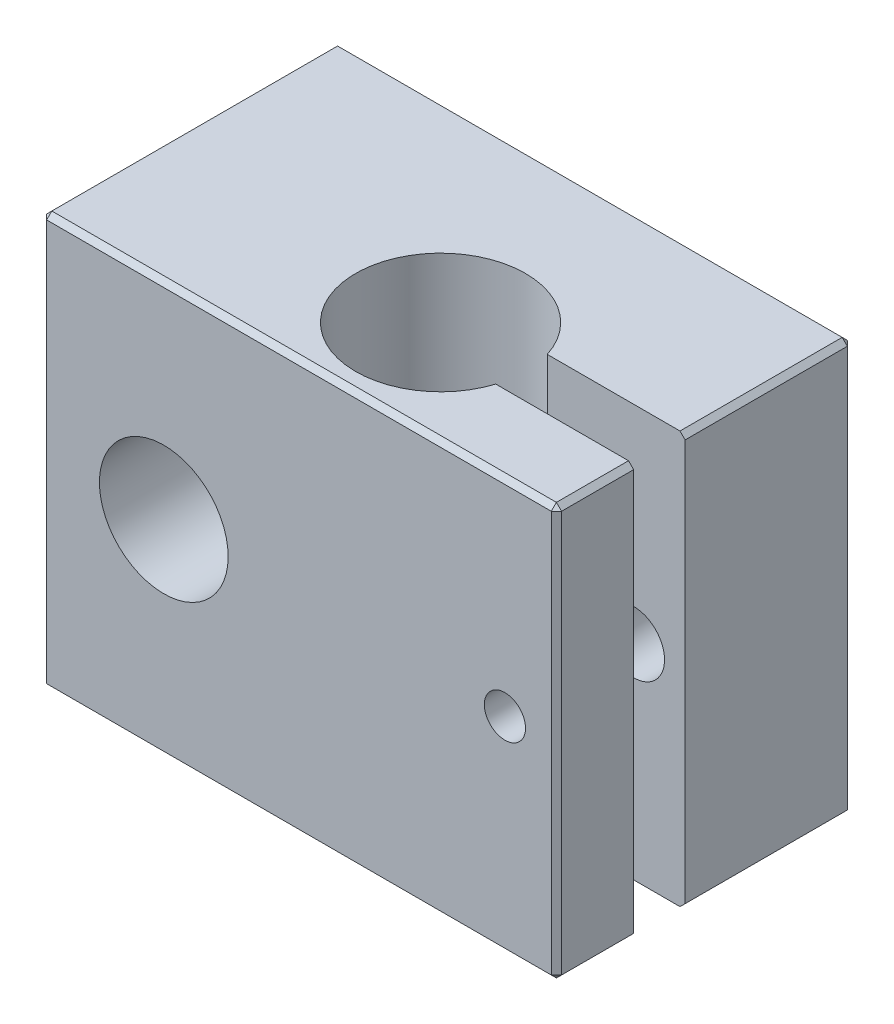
ISO-10303-21;
HEADER;
FILE_DESCRIPTION(('STEP AP214'),'2;1');
FILE_NAME('part.step','',(''),(''),'','','');
FILE_SCHEMA(('AUTOMOTIVE_DESIGN { 1 0 10303 214 1 1 1 1 }'));
ENDSEC;
DATA;
#1=APPLICATION_CONTEXT('core data for automotive mechanical design processes');
#2=APPLICATION_PROTOCOL_DEFINITION('international standard','automotive_design',2000,#1);
#3=PRODUCT_CONTEXT('',#1,'mechanical');
#4=PRODUCT('Part','Part','',(#3));
#5=PRODUCT_RELATED_PRODUCT_CATEGORY('part','',(#4));
#6=PRODUCT_DEFINITION_FORMATION('','',#4);
#7=PRODUCT_DEFINITION_CONTEXT('part definition',#1,'design');
#8=PRODUCT_DEFINITION('design','',#6,#7);
#9=PRODUCT_DEFINITION_SHAPE('','',#8);
#10=(LENGTH_UNIT() NAMED_UNIT(*) SI_UNIT(.MILLI.,.METRE.));
#11=(NAMED_UNIT(*) PLANE_ANGLE_UNIT() SI_UNIT($,.RADIAN.));
#12=(NAMED_UNIT(*) SI_UNIT($,.STERADIAN.) SOLID_ANGLE_UNIT());
#13=UNCERTAINTY_MEASURE_WITH_UNIT(LENGTH_MEASURE(1.E-05),#10,'distance_accuracy_value','');
#14=(GEOMETRIC_REPRESENTATION_CONTEXT(3) GLOBAL_UNCERTAINTY_ASSIGNED_CONTEXT((#13)) GLOBAL_UNIT_ASSIGNED_CONTEXT((#10,
#11,#12)) REPRESENTATION_CONTEXT('',''));
#15=CARTESIAN_POINT('',(0.,0.,0.));
#16=DIRECTION('',(0.,0.,1.));
#17=DIRECTION('',(1.,0.,0.));
#18=AXIS2_PLACEMENT_3D('',#15,#16,#17);
#19=CARTESIAN_POINT('',(0.,0.,0.));
#20=DIRECTION('',(0.,0.,1.));
#21=DIRECTION('',(1.,0.,0.));
#22=AXIS2_PLACEMENT_3D('',#19,#20,#21);
#23=PLANE('',#22);
#24=DIRECTION('',(0.,-1.,0.));
#25=VECTOR('',#24,1.);
#26=CARTESIAN_POINT('',(15.05,0.,0.));
#27=LINE('',#26,#25);
#28=CARTESIAN_POINT('',(15.05,7.8,0.));
#29=VERTEX_POINT('',#28);
#30=CARTESIAN_POINT('',(15.05,-7.8,0.));
#31=VERTEX_POINT('',#30);
#32=EDGE_CURVE('E241',#29,#31,#27,.T.);
#33=ORIENTED_EDGE('',*,*,#32,.T.);
#34=DIRECTION('',(-1.,0.,0.));
#35=VECTOR('',#34,1.);
#36=CARTESIAN_POINT('',(0.,-7.8,0.));
#37=LINE('',#36,#35);
#38=CARTESIAN_POINT('',(-4.55,-7.8,0.));
#39=VERTEX_POINT('',#38);
#40=EDGE_CURVE('E245',#31,#39,#37,.T.);
#41=ORIENTED_EDGE('',*,*,#40,.T.);
#42=DIRECTION('',(0.,1.,0.));
#43=VECTOR('',#42,1.);
#44=CARTESIAN_POINT('',(-4.55,0.,0.));
#45=LINE('',#44,#43);
#46=CARTESIAN_POINT('',(-4.55,7.8,0.));
#47=VERTEX_POINT('',#46);
#48=EDGE_CURVE('E243',#39,#47,#45,.T.);
#49=ORIENTED_EDGE('',*,*,#48,.T.);
#50=DIRECTION('',(1.,0.,0.));
#51=VECTOR('',#50,1.);
#52=CARTESIAN_POINT('',(0.,7.8,0.));
#53=LINE('',#52,#51);
#54=EDGE_CURVE('E239',#47,#29,#53,.T.);
#55=ORIENTED_EDGE('',*,*,#54,.T.);
#56=EDGE_LOOP('',(#33,#41,#49,#55));
#57=FACE_BOUND('',#56,.T.);
#58=CARTESIAN_POINT('',(0.,0.,0.));
#59=DIRECTION('',(0.,0.,1.));
#60=DIRECTION('',(1.,0.,0.));
#61=AXIS2_PLACEMENT_3D('',#58,#59,#60);
#62=CIRCLE('',#61,2.5);
#63=CARTESIAN_POINT('',(2.5,0.,0.));
#64=VERTEX_POINT('',#63);
#65=EDGE_CURVE('E181',#64,#64,#62,.T.);
#66=ORIENTED_EDGE('',*,*,#65,.T.);
#67=EDGE_LOOP('',(#66));
#68=FACE_BOUND('',#67,.T.);
#69=CARTESIAN_POINT('',(13.25,0.,0.));
#70=DIRECTION('',(0.,0.,-1.));
#71=DIRECTION('',(-1.,0.,0.));
#72=AXIS2_PLACEMENT_3D('',#69,#70,#71);
#73=CIRCLE('',#72,1.19999999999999);
#74=CARTESIAN_POINT('',(12.05,0.,0.));
#75=VERTEX_POINT('',#74);
#76=EDGE_CURVE('E357',#75,#75,#73,.T.);
#77=ORIENTED_EDGE('',*,*,#76,.F.);
#78=EDGE_LOOP('',(#77));
#79=FACE_BOUND('',#78,.T.);
#80=ADVANCED_FACE('F38',(#57,#68,#79),#23,.F.);
#81=CARTESIAN_POINT('',(15.25,8.,11.5));
#82=DIRECTION('',(-1.,0.,0.));
#83=DIRECTION('',(0.,-1.,0.));
#84=AXIS2_PLACEMENT_3D('',#81,#82,#83);
#85=PLANE('',#84);
#86=DIRECTION('',(0.,-1.,0.));
#87=VECTOR('',#86,1.);
#88=CARTESIAN_POINT('',(15.25,-8.,11.3));
#89=LINE('',#88,#87);
#90=CARTESIAN_POINT('',(15.25,7.8,11.3));
#91=VERTEX_POINT('',#90);
#92=CARTESIAN_POINT('',(15.25,-7.8,11.3));
#93=VERTEX_POINT('',#92);
#94=EDGE_CURVE('E277',#91,#93,#89,.T.);
#95=ORIENTED_EDGE('',*,*,#94,.T.);
#96=DIRECTION('',(0.,0.,-1.));
#97=VECTOR('',#96,1.);
#98=CARTESIAN_POINT('',(15.25,-7.8,11.5));
#99=LINE('',#98,#97);
#100=CARTESIAN_POINT('',(15.25,-7.8,8.5));
#101=VERTEX_POINT('',#100);
#102=EDGE_CURVE('E281',#93,#101,#99,.T.);
#103=ORIENTED_EDGE('',*,*,#102,.T.);
#104=DIRECTION('',(0.,1.,0.));
#105=VECTOR('',#104,1.);
#106=CARTESIAN_POINT('',(15.25,8.,8.5));
#107=LINE('',#106,#105);
#108=CARTESIAN_POINT('',(15.25,7.8,8.5));
#109=VERTEX_POINT('',#108);
#110=EDGE_CURVE('E198',#101,#109,#107,.T.);
#111=ORIENTED_EDGE('',*,*,#110,.T.);
#112=DIRECTION('',(0.,0.,1.));
#113=VECTOR('',#112,1.);
#114=CARTESIAN_POINT('',(15.25,7.8,11.5));
#115=LINE('',#114,#113);
#116=EDGE_CURVE('E279',#109,#91,#115,.T.);
#117=ORIENTED_EDGE('',*,*,#116,.T.);
#118=EDGE_LOOP('',(#95,#103,#111,#117));
#119=FACE_BOUND('',#118,.T.);
#120=ADVANCED_FACE('F487',(#119),#85,.F.);
#121=CARTESIAN_POINT('',(-4.75,8.,11.5));
#122=DIRECTION('',(1.,0.,0.));
#123=DIRECTION('',(0.,1.,0.));
#124=AXIS2_PLACEMENT_3D('',#121,#122,#123);
#125=PLANE('',#124);
#126=DIRECTION('',(0.,-1.,0.));
#127=VECTOR('',#126,1.);
#128=CARTESIAN_POINT('',(-4.75,8.,0.200000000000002));
#129=LINE('',#128,#127);
#130=CARTESIAN_POINT('',(-4.75,7.8,0.200000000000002));
#131=VERTEX_POINT('',#130);
#132=CARTESIAN_POINT('',(-4.75,-7.8,0.200000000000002));
#133=VERTEX_POINT('',#132);
#134=EDGE_CURVE('E252',#131,#133,#129,.T.);
#135=ORIENTED_EDGE('',*,*,#134,.T.);
#136=DIRECTION('',(0.,0.,1.));
#137=VECTOR('',#136,1.);
#138=CARTESIAN_POINT('',(-4.75,-7.8,11.5));
#139=LINE('',#138,#137);
#140=CARTESIAN_POINT('',(-4.75,-7.8,11.3));
#141=VERTEX_POINT('',#140);
#142=EDGE_CURVE('E254',#133,#141,#139,.T.);
#143=ORIENTED_EDGE('',*,*,#142,.T.);
#144=DIRECTION('',(0.,1.,0.));
#145=VECTOR('',#144,1.);
#146=CARTESIAN_POINT('',(-4.75,8.,11.3));
#147=LINE('',#146,#145);
#148=CARTESIAN_POINT('',(-4.75,7.8,11.3));
#149=VERTEX_POINT('',#148);
#150=EDGE_CURVE('E248',#141,#149,#147,.T.);
#151=ORIENTED_EDGE('',*,*,#150,.T.);
#152=DIRECTION('',(0.,0.,-1.));
#153=VECTOR('',#152,1.);
#154=CARTESIAN_POINT('',(-4.75,7.8,11.5));
#155=LINE('',#154,#153);
#156=EDGE_CURVE('E250',#149,#131,#155,.T.);
#157=ORIENTED_EDGE('',*,*,#156,.T.);
#158=EDGE_LOOP('',(#135,#143,#151,#157));
#159=FACE_BOUND('',#158,.T.);
#160=ADVANCED_FACE('F492',(#159),#125,.F.);
#161=CARTESIAN_POINT('',(-4.75,-8.,11.5));
#162=DIRECTION('',(0.,1.,0.));
#163=DIRECTION('',(0.,0.,1.));
#164=AXIS2_PLACEMENT_3D('',#161,#162,#163);
#165=PLANE('',#164);
#166=CARTESIAN_POINT('',(-1.25,-8.,6.5));
#167=DIRECTION('',(0.,-1.,0.));
#168=DIRECTION('',(0.,0.,-1.));
#169=AXIS2_PLACEMENT_3D('',#166,#167,#168);
#170=CIRCLE('',#169,1.025);
#171=CARTESIAN_POINT('',(-1.25,-8.,5.475));
#172=VERTEX_POINT('',#171);
#173=EDGE_CURVE('E200',#172,#172,#170,.T.);
#174=ORIENTED_EDGE('',*,*,#173,.F.);
#175=EDGE_LOOP('',(#174));
#176=FACE_BOUND('',#175,.T.);
#177=CARTESIAN_POINT('',(-2.25,-8.,9.));
#178=DIRECTION('',(0.,-1.,0.));
#179=DIRECTION('',(0.,0.,-1.));
#180=AXIS2_PLACEMENT_3D('',#177,#178,#179);
#181=CIRCLE('',#180,1.00000000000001);
#182=CARTESIAN_POINT('',(-2.25,-8.,7.99999999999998));
#183=VERTEX_POINT('',#182);
#184=EDGE_CURVE('E212',#183,#183,#181,.T.);
#185=ORIENTED_EDGE('',*,*,#184,.F.);
#186=EDGE_LOOP('',(#185));
#187=FACE_BOUND('',#186,.T.);
#188=DIRECTION('',(1.,0.,0.));
#189=VECTOR('',#188,1.);
#190=CARTESIAN_POINT('',(-4.75,-8.,0.200000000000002));
#191=LINE('',#190,#189);
#192=CARTESIAN_POINT('',(-4.55,-8.,0.200000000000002));
#193=VERTEX_POINT('',#192);
#194=CARTESIAN_POINT('',(15.05,-8.,0.200000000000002));
#195=VERTEX_POINT('',#194);
#196=EDGE_CURVE('E236',#193,#195,#191,.T.);
#197=ORIENTED_EDGE('',*,*,#196,.T.);
#198=DIRECTION('',(0.,0.,1.));
#199=VECTOR('',#198,1.);
#200=CARTESIAN_POINT('',(15.05,-8.,11.5));
#201=LINE('',#200,#199);
#202=CARTESIAN_POINT('',(15.05,-8.,6.5));
#203=VERTEX_POINT('',#202);
#204=EDGE_CURVE('E190',#195,#203,#201,.T.);
#205=ORIENTED_EDGE('',*,*,#204,.T.);
#206=DIRECTION('',(1.,0.,0.));
#207=VECTOR('',#206,1.);
#208=CARTESIAN_POINT('',(6.75,-8.,6.5));
#209=LINE('',#208,#207);
#210=CARTESIAN_POINT('',(9.89483703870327,-8.,6.5));
#211=VERTEX_POINT('',#210);
#212=EDGE_CURVE('E172',#211,#203,#209,.T.);
#213=ORIENTED_EDGE('',*,*,#212,.F.);
#214=CARTESIAN_POINT('',(6.75,-8.,7.5));
#215=DIRECTION('',(0.,-1.,0.));
#216=DIRECTION('',(0.,0.,-1.));
#217=AXIS2_PLACEMENT_3D('',#214,#215,#216);
#218=CIRCLE('',#217,3.29999999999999);
#219=CARTESIAN_POINT('',(9.89483703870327,-8.,8.5));
#220=VERTEX_POINT('',#219);
#221=EDGE_CURVE('E188',#220,#211,#218,.T.);
#222=ORIENTED_EDGE('',*,*,#221,.F.);
#223=DIRECTION('',(-1.,0.,0.));
#224=VECTOR('',#223,1.);
#225=CARTESIAN_POINT('',(6.75,-8.,8.5));
#226=LINE('',#225,#224);
#227=CARTESIAN_POINT('',(15.05,-8.,8.5));
#228=VERTEX_POINT('',#227);
#229=EDGE_CURVE('E191',#228,#220,#226,.T.);
#230=ORIENTED_EDGE('',*,*,#229,.F.);
#231=DIRECTION('',(0.,0.,1.));
#232=VECTOR('',#231,1.);
#233=CARTESIAN_POINT('',(15.05,-8.,11.5));
#234=LINE('',#233,#232);
#235=CARTESIAN_POINT('',(15.05,-8.,11.3));
#236=VERTEX_POINT('',#235);
#237=EDGE_CURVE('E232',#228,#236,#234,.T.);
#238=ORIENTED_EDGE('',*,*,#237,.T.);
#239=DIRECTION('',(-1.,0.,0.));
#240=VECTOR('',#239,1.);
#241=CARTESIAN_POINT('',(-4.75,-8.,11.3));
#242=LINE('',#241,#240);
#243=CARTESIAN_POINT('',(-4.55,-8.,11.3));
#244=VERTEX_POINT('',#243);
#245=EDGE_CURVE('E230',#236,#244,#242,.T.);
#246=ORIENTED_EDGE('',*,*,#245,.T.);
#247=DIRECTION('',(0.,0.,-1.));
#248=VECTOR('',#247,1.);
#249=CARTESIAN_POINT('',(-4.55,-8.,11.5));
#250=LINE('',#249,#248);
#251=EDGE_CURVE('E234',#244,#193,#250,.T.);
#252=ORIENTED_EDGE('',*,*,#251,.T.);
#253=EDGE_LOOP('',(#197,#205,#213,#222,#230,#238,#246,#252));
#254=FACE_BOUND('',#253,.T.);
#255=ADVANCED_FACE('F186',(#176,#187,#254),#165,.F.);
#256=DIRECTION('',(0.,-1.,0.));
#257=VECTOR('',#256,1.);
#258=CARTESIAN_POINT('',(15.25,8.,6.5));
#259=LINE('',#258,#257);
#260=CARTESIAN_POINT('',(15.25,7.8,6.5));
#261=VERTEX_POINT('',#260);
#262=CARTESIAN_POINT('',(15.25,-7.8,6.5));
#263=VERTEX_POINT('',#262);
#264=EDGE_CURVE('E203',#261,#263,#259,.T.);
#265=ORIENTED_EDGE('',*,*,#264,.T.);
#266=DIRECTION('',(0.,0.,-1.));
#267=VECTOR('',#266,1.);
#268=CARTESIAN_POINT('',(15.25,-7.8,11.5));
#269=LINE('',#268,#267);
#270=CARTESIAN_POINT('',(15.25,-7.8,0.200000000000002));
#271=VERTEX_POINT('',#270);
#272=EDGE_CURVE('E261',#263,#271,#269,.T.);
#273=ORIENTED_EDGE('',*,*,#272,.T.);
#274=DIRECTION('',(0.,1.,0.));
#275=VECTOR('',#274,1.);
#276=CARTESIAN_POINT('',(15.25,8.,0.200000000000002));
#277=LINE('',#276,#275);
#278=CARTESIAN_POINT('',(15.25,7.8,0.200000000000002));
#279=VERTEX_POINT('',#278);
#280=EDGE_CURVE('E259',#271,#279,#277,.T.);
#281=ORIENTED_EDGE('',*,*,#280,.T.);
#282=DIRECTION('',(0.,0.,1.));
#283=VECTOR('',#282,1.);
#284=CARTESIAN_POINT('',(15.25,7.8,11.5));
#285=LINE('',#284,#283);
#286=EDGE_CURVE('E257',#279,#261,#285,.T.);
#287=ORIENTED_EDGE('',*,*,#286,.T.);
#288=EDGE_LOOP('',(#265,#273,#281,#287));
#289=FACE_BOUND('',#288,.T.);
#290=ADVANCED_FACE('F381',(#289),#85,.F.);
#291=CARTESIAN_POINT('',(-4.75,8.,11.5));
#292=DIRECTION('',(0.,-1.,0.));
#293=DIRECTION('',(0.,0.,-1.));
#294=AXIS2_PLACEMENT_3D('',#291,#292,#293);
#295=PLANE('',#294);
#296=DIRECTION('',(1.,0.,0.));
#297=VECTOR('',#296,1.);
#298=CARTESIAN_POINT('',(6.75,8.,6.5));
#299=LINE('',#298,#297);
#300=CARTESIAN_POINT('',(9.89483703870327,8.,6.5));
#301=VERTEX_POINT('',#300);
#302=CARTESIAN_POINT('',(15.05,8.,6.5));
#303=VERTEX_POINT('',#302);
#304=EDGE_CURVE('E175',#301,#303,#299,.T.);
#305=ORIENTED_EDGE('',*,*,#304,.T.);
#306=DIRECTION('',(0.,0.,-1.));
#307=VECTOR('',#306,1.);
#308=CARTESIAN_POINT('',(15.05,8.,11.5));
#309=LINE('',#308,#307);
#310=CARTESIAN_POINT('',(15.05,8.,0.200000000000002));
#311=VERTEX_POINT('',#310);
#312=EDGE_CURVE('E275',#303,#311,#309,.T.);
#313=ORIENTED_EDGE('',*,*,#312,.T.);
#314=DIRECTION('',(-1.,0.,0.));
#315=VECTOR('',#314,1.);
#316=CARTESIAN_POINT('',(-4.75,8.,0.200000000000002));
#317=LINE('',#316,#315);
#318=CARTESIAN_POINT('',(-4.55,8.,0.200000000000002));
#319=VERTEX_POINT('',#318);
#320=EDGE_CURVE('E273',#311,#319,#317,.T.);
#321=ORIENTED_EDGE('',*,*,#320,.T.);
#322=DIRECTION('',(0.,0.,1.));
#323=VECTOR('',#322,1.);
#324=CARTESIAN_POINT('',(-4.55,8.,11.5));
#325=LINE('',#324,#323);
#326=CARTESIAN_POINT('',(-4.55,8.,11.3));
#327=VERTEX_POINT('',#326);
#328=EDGE_CURVE('E271',#319,#327,#325,.T.);
#329=ORIENTED_EDGE('',*,*,#328,.T.);
#330=DIRECTION('',(1.,0.,0.));
#331=VECTOR('',#330,1.);
#332=CARTESIAN_POINT('',(15.25,8.,11.3));
#333=LINE('',#332,#331);
#334=CARTESIAN_POINT('',(15.05,8.,11.3));
#335=VERTEX_POINT('',#334);
#336=EDGE_CURVE('E267',#327,#335,#333,.T.);
#337=ORIENTED_EDGE('',*,*,#336,.T.);
#338=DIRECTION('',(0.,0.,-1.));
#339=VECTOR('',#338,1.);
#340=CARTESIAN_POINT('',(15.05,8.,11.5));
#341=LINE('',#340,#339);
#342=CARTESIAN_POINT('',(15.05,8.,8.5));
#343=VERTEX_POINT('',#342);
#344=EDGE_CURVE('E269',#335,#343,#341,.T.);
#345=ORIENTED_EDGE('',*,*,#344,.T.);
#346=DIRECTION('',(-1.,0.,0.));
#347=VECTOR('',#346,1.);
#348=CARTESIAN_POINT('',(6.75,8.,8.5));
#349=LINE('',#348,#347);
#350=CARTESIAN_POINT('',(9.89483703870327,8.,8.5));
#351=VERTEX_POINT('',#350);
#352=EDGE_CURVE('E375',#343,#351,#349,.T.);
#353=ORIENTED_EDGE('',*,*,#352,.T.);
#354=CARTESIAN_POINT('',(6.75,8.,7.5));
#355=DIRECTION('',(0.,-1.,0.));
#356=DIRECTION('',(0.,0.,-1.));
#357=AXIS2_PLACEMENT_3D('',#354,#355,#356);
#358=CIRCLE('',#357,3.3);
#359=EDGE_CURVE('E197',#351,#301,#358,.T.);
#360=ORIENTED_EDGE('',*,*,#359,.T.);
#361=EDGE_LOOP('',(#305,#313,#321,#329,#337,#345,#353,#360));
#362=FACE_BOUND('',#361,.T.);
#363=ADVANCED_FACE('F417',(#362),#295,.F.);
#364=CARTESIAN_POINT('',(0.,0.,11.5));
#365=DIRECTION('',(0.,0.,1.));
#366=DIRECTION('',(1.,0.,0.));
#367=AXIS2_PLACEMENT_3D('',#364,#365,#366);
#368=PLANE('',#367);
#369=DIRECTION('',(0.,-1.,0.));
#370=VECTOR('',#369,1.);
#371=CARTESIAN_POINT('',(-4.55,-8.,11.5));
#372=LINE('',#371,#370);
#373=CARTESIAN_POINT('',(-4.55,7.8,11.5));
#374=VERTEX_POINT('',#373);
#375=CARTESIAN_POINT('',(-4.55,-7.8,11.5));
#376=VERTEX_POINT('',#375);
#377=EDGE_CURVE('E287',#374,#376,#372,.T.);
#378=ORIENTED_EDGE('',*,*,#377,.T.);
#379=DIRECTION('',(1.,0.,0.));
#380=VECTOR('',#379,1.);
#381=CARTESIAN_POINT('',(15.25,-7.8,11.5));
#382=LINE('',#381,#380);
#383=CARTESIAN_POINT('',(15.05,-7.8,11.5));
#384=VERTEX_POINT('',#383);
#385=EDGE_CURVE('E11',#376,#384,#382,.T.);
#386=ORIENTED_EDGE('',*,*,#385,.T.);
#387=DIRECTION('',(0.,1.,0.));
#388=VECTOR('',#387,1.);
#389=CARTESIAN_POINT('',(15.05,8.,11.5));
#390=LINE('',#389,#388);
#391=CARTESIAN_POINT('',(15.05,7.8,11.5));
#392=VERTEX_POINT('',#391);
#393=EDGE_CURVE('E47',#384,#392,#390,.T.);
#394=ORIENTED_EDGE('',*,*,#393,.T.);
#395=DIRECTION('',(-1.,0.,0.));
#396=VECTOR('',#395,1.);
#397=CARTESIAN_POINT('',(-4.75,7.8,11.5));
#398=LINE('',#397,#396);
#399=EDGE_CURVE('E289',#392,#374,#398,.T.);
#400=ORIENTED_EDGE('',*,*,#399,.T.);
#401=EDGE_LOOP('',(#378,#386,#394,#400));
#402=FACE_BOUND('',#401,.T.);
#403=CARTESIAN_POINT('',(13.25,0.,11.5));
#404=DIRECTION('',(0.,0.,1.));
#405=DIRECTION('',(1.,0.,0.));
#406=AXIS2_PLACEMENT_3D('',#403,#404,#405);
#407=CIRCLE('',#406,0.799999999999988);
#408=CARTESIAN_POINT('',(14.05,0.,11.5));
#409=VERTEX_POINT('',#408);
#410=EDGE_CURVE('E367',#409,#409,#407,.T.);
#411=ORIENTED_EDGE('',*,*,#410,.F.);
#412=EDGE_LOOP('',(#411));
#413=FACE_BOUND('',#412,.T.);
#414=CARTESIAN_POINT('',(0.,0.,11.5));
#415=DIRECTION('',(0.,0.,1.));
#416=DIRECTION('',(1.,0.,0.));
#417=AXIS2_PLACEMENT_3D('',#414,#415,#416);
#418=CIRCLE('',#417,2.49999999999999);
#419=CARTESIAN_POINT('',(2.49999999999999,0.,11.5));
#420=VERTEX_POINT('',#419);
#421=EDGE_CURVE('E224',#420,#420,#418,.T.);
#422=ORIENTED_EDGE('',*,*,#421,.F.);
#423=EDGE_LOOP('',(#422));
#424=FACE_BOUND('',#423,.T.);
#425=ADVANCED_FACE('F466',(#402,#413,#424),#368,.T.);
#426=CARTESIAN_POINT('',(0.,0.,11.5));
#427=DIRECTION('',(0.,0.,1.));
#428=DIRECTION('',(1.,0.,0.));
#429=AXIS2_PLACEMENT_3D('',#426,#427,#428);
#430=CYLINDRICAL_SURFACE('',#429,2.49999999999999);
#431=ORIENTED_EDGE('',*,*,#65,.F.);
#432=EDGE_LOOP('',(#431));
#433=FACE_BOUND('',#432,.T.);
#434=ORIENTED_EDGE('',*,*,#421,.T.);
#435=EDGE_LOOP('',(#434));
#436=FACE_BOUND('',#435,.T.);
#437=ADVANCED_FACE('F469',(#433,#436),#430,.F.);
#438=CARTESIAN_POINT('',(-2.25,-3.5,9.));
#439=DIRECTION('',(0.,1.,0.));
#440=DIRECTION('',(0.,0.,1.));
#441=AXIS2_PLACEMENT_3D('',#438,#439,#440);
#442=PLANE('',#441);
#443=CARTESIAN_POINT('',(-2.25,-3.5,9.));
#444=DIRECTION('',(0.,-1.,0.));
#445=DIRECTION('',(0.,0.,-1.));
#446=AXIS2_PLACEMENT_3D('',#443,#444,#445);
#447=CIRCLE('',#446,0.500000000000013);
#448=CARTESIAN_POINT('',(-2.25,-3.5,8.49999999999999));
#449=VERTEX_POINT('',#448);
#450=EDGE_CURVE('E221',#449,#449,#447,.T.);
#451=ORIENTED_EDGE('',*,*,#450,.T.);
#452=EDGE_LOOP('',(#451));
#453=FACE_BOUND('',#452,.T.);
#454=ADVANCED_FACE('F476',(#453),#442,.F.);
#455=CARTESIAN_POINT('',(-2.25,-8.,9.));
#456=DIRECTION('',(0.,-1.,0.));
#457=DIRECTION('',(0.,0.,-1.));
#458=AXIS2_PLACEMENT_3D('',#455,#456,#457);
#459=CYLINDRICAL_SURFACE('',#458,0.500000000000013);
#460=ORIENTED_EDGE('',*,*,#450,.F.);
#461=EDGE_LOOP('',(#460));
#462=FACE_BOUND('',#461,.T.);
#463=CARTESIAN_POINT('',(-2.25,-6.,9.));
#464=DIRECTION('',(0.,-1.,0.));
#465=DIRECTION('',(0.,0.,-1.));
#466=AXIS2_PLACEMENT_3D('',#463,#464,#465);
#467=CIRCLE('',#466,0.500000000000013);
#468=CARTESIAN_POINT('',(-2.25,-6.,8.49999999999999));
#469=VERTEX_POINT('',#468);
#470=EDGE_CURVE('E218',#469,#469,#467,.T.);
#471=ORIENTED_EDGE('',*,*,#470,.T.);
#472=EDGE_LOOP('',(#471));
#473=FACE_BOUND('',#472,.T.);
#474=ADVANCED_FACE('F482',(#462,#473),#459,.F.);
#475=CARTESIAN_POINT('',(-1.74999999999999,-6.,9.));
#476=DIRECTION('',(0.,1.,0.));
#477=DIRECTION('',(0.,0.,1.));
#478=AXIS2_PLACEMENT_3D('',#475,#476,#477);
#479=PLANE('',#478);
#480=ORIENTED_EDGE('',*,*,#470,.F.);
#481=EDGE_LOOP('',(#480));
#482=FACE_BOUND('',#481,.T.);
#483=CARTESIAN_POINT('',(-2.25,-6.,9.));
#484=DIRECTION('',(0.,-1.,0.));
#485=DIRECTION('',(0.,0.,-1.));
#486=AXIS2_PLACEMENT_3D('',#483,#484,#485);
#487=CIRCLE('',#486,1.00000000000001);
#488=CARTESIAN_POINT('',(-2.25,-6.,7.99999999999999));
#489=VERTEX_POINT('',#488);
#490=EDGE_CURVE('E215',#489,#489,#487,.T.);
#491=ORIENTED_EDGE('',*,*,#490,.T.);
#492=EDGE_LOOP('',(#491));
#493=FACE_BOUND('',#492,.T.);
#494=ADVANCED_FACE('F589',(#482,#493),#479,.F.);
#495=CARTESIAN_POINT('',(-2.25,-8.,9.));
#496=DIRECTION('',(0.,-1.,0.));
#497=DIRECTION('',(0.,0.,-1.));
#498=AXIS2_PLACEMENT_3D('',#495,#496,#497);
#499=CYLINDRICAL_SURFACE('',#498,1.00000000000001);
#500=ORIENTED_EDGE('',*,*,#490,.F.);
#501=EDGE_LOOP('',(#500));
#502=FACE_BOUND('',#501,.T.);
#503=ORIENTED_EDGE('',*,*,#184,.T.);
#504=EDGE_LOOP('',(#503));
#505=FACE_BOUND('',#504,.T.);
#506=ADVANCED_FACE('F585',(#502,#505),#499,.F.);
#507=CARTESIAN_POINT('',(-1.25,-3.5,6.5));
#508=DIRECTION('',(0.,-1.,0.));
#509=DIRECTION('',(0.,0.,-1.));
#510=AXIS2_PLACEMENT_3D('',#507,#508,#509);
#511=CONICAL_SURFACE('',#510,1.025,1.02974425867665);
#512=CARTESIAN_POINT('',(-1.25,-2.88411786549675,6.5));
#513=VERTEX_POINT('',#512);
#514=VERTEX_LOOP('',#513);
#515=FACE_BOUND('',#514,.T.);
#516=CARTESIAN_POINT('',(-1.25,-3.5,6.5));
#517=DIRECTION('',(0.,-1.,0.));
#518=DIRECTION('',(0.,0.,-1.));
#519=AXIS2_PLACEMENT_3D('',#516,#517,#518);
#520=CIRCLE('',#519,1.025);
#521=CARTESIAN_POINT('',(-1.25,-3.5,5.475));
#522=VERTEX_POINT('',#521);
#523=EDGE_CURVE('E209',#522,#522,#520,.T.);
#524=ORIENTED_EDGE('',*,*,#523,.T.);
#525=EDGE_LOOP('',(#524));
#526=FACE_BOUND('',#525,.T.);
#527=ADVANCED_FACE('F581',(#515,#526),#511,.F.);
#528=CARTESIAN_POINT('',(-1.25,-8.,6.5));
#529=DIRECTION('',(0.,-1.,0.));
#530=DIRECTION('',(0.,0.,-1.));
#531=AXIS2_PLACEMENT_3D('',#528,#529,#530);
#532=CYLINDRICAL_SURFACE('',#531,1.025);
#533=ORIENTED_EDGE('',*,*,#523,.F.);
#534=EDGE_LOOP('',(#533));
#535=FACE_BOUND('',#534,.T.);
#536=ORIENTED_EDGE('',*,*,#173,.T.);
#537=EDGE_LOOP('',(#536));
#538=FACE_BOUND('',#537,.T.);
#539=ADVANCED_FACE('F578',(#535,#538),#532,.F.);
#540=CARTESIAN_POINT('',(6.75,-8.,7.5));
#541=DIRECTION('',(0.,-1.,0.));
#542=DIRECTION('',(0.,0.,-1.));
#543=AXIS2_PLACEMENT_3D('',#540,#541,#542);
#544=CYLINDRICAL_SURFACE('',#543,3.29999999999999);
#545=ORIENTED_EDGE('',*,*,#359,.F.);
#546=DIRECTION('',(0.,-1.,0.));
#547=VECTOR('',#546,1.);
#548=CARTESIAN_POINT('',(9.89483703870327,-8.,8.5));
#549=LINE('',#548,#547);
#550=EDGE_CURVE('E180',#351,#220,#549,.T.);
#551=ORIENTED_EDGE('',*,*,#550,.T.);
#552=ORIENTED_EDGE('',*,*,#221,.T.);
#553=DIRECTION('',(0.,-1.,0.));
#554=VECTOR('',#553,1.);
#555=CARTESIAN_POINT('',(9.89483703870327,-8.,6.5));
#556=LINE('',#555,#554);
#557=EDGE_CURVE('E169',#211,#301,#556,.F.);
#558=ORIENTED_EDGE('',*,*,#557,.T.);
#559=EDGE_LOOP('',(#545,#551,#552,#558));
#560=FACE_BOUND('',#559,.T.);
#561=ADVANCED_FACE('F195',(#560),#544,.F.);
#562=CARTESIAN_POINT('',(6.75,8.,6.5));
#563=DIRECTION('',(0.,0.,-1.));
#564=DIRECTION('',(-1.,0.,0.));
#565=AXIS2_PLACEMENT_3D('',#562,#563,#564);
#566=PLANE('',#565);
#567=CARTESIAN_POINT('',(13.25,0.,6.5));
#568=DIRECTION('',(0.,0.,-1.));
#569=DIRECTION('',(-1.,0.,0.));
#570=AXIS2_PLACEMENT_3D('',#567,#568,#569);
#571=CIRCLE('',#570,1.19999999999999);
#572=CARTESIAN_POINT('',(12.05,0.,6.5));
#573=VERTEX_POINT('',#572);
#574=EDGE_CURVE('E362',#573,#573,#571,.T.);
#575=ORIENTED_EDGE('',*,*,#574,.T.);
#576=EDGE_LOOP('',(#575));
#577=FACE_BOUND('',#576,.T.);
#578=ORIENTED_EDGE('',*,*,#212,.T.);
#579=DIRECTION('',(-0.707106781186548,-0.707106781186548,0.));
#580=VECTOR('',#579,1.);
#581=CARTESIAN_POINT('',(15.25,-7.8,6.5));
#582=LINE('',#581,#580);
#583=EDGE_CURVE('E265',#203,#263,#582,.F.);
#584=ORIENTED_EDGE('',*,*,#583,.T.);
#585=ORIENTED_EDGE('',*,*,#264,.F.);
#586=DIRECTION('',(0.707106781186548,-0.707106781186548,0.));
#587=VECTOR('',#586,1.);
#588=CARTESIAN_POINT('',(15.05,8.,6.5));
#589=LINE('',#588,#587);
#590=EDGE_CURVE('E263',#261,#303,#589,.F.);
#591=ORIENTED_EDGE('',*,*,#590,.T.);
#592=ORIENTED_EDGE('',*,*,#304,.F.);
#593=ORIENTED_EDGE('',*,*,#557,.F.);
#594=EDGE_LOOP('',(#578,#584,#585,#591,#592,#593));
#595=FACE_BOUND('',#594,.T.);
#596=ADVANCED_FACE('F171',(#577,#595),#566,.F.);
#597=CARTESIAN_POINT('',(6.75,8.,8.5));
#598=DIRECTION('',(0.,0.,1.));
#599=DIRECTION('',(1.,0.,0.));
#600=AXIS2_PLACEMENT_3D('',#597,#598,#599);
#601=PLANE('',#600);
#602=CARTESIAN_POINT('',(13.25,0.,8.5));
#603=DIRECTION('',(0.,0.,1.));
#604=DIRECTION('',(1.,0.,0.));
#605=AXIS2_PLACEMENT_3D('',#602,#603,#604);
#606=CIRCLE('',#605,0.799999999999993);
#607=CARTESIAN_POINT('',(14.05,0.,8.5));
#608=VERTEX_POINT('',#607);
#609=EDGE_CURVE('E192',#608,#608,#606,.T.);
#610=ORIENTED_EDGE('',*,*,#609,.T.);
#611=EDGE_LOOP('',(#610));
#612=FACE_BOUND('',#611,.T.);
#613=ORIENTED_EDGE('',*,*,#110,.F.);
#614=DIRECTION('',(0.707106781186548,0.707106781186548,0.));
#615=VECTOR('',#614,1.);
#616=CARTESIAN_POINT('',(15.25,-7.8,8.5));
#617=LINE('',#616,#615);
#618=EDGE_CURVE('E285',#101,#228,#617,.F.);
#619=ORIENTED_EDGE('',*,*,#618,.T.);
#620=ORIENTED_EDGE('',*,*,#229,.T.);
#621=ORIENTED_EDGE('',*,*,#550,.F.);
#622=ORIENTED_EDGE('',*,*,#352,.F.);
#623=DIRECTION('',(-0.707106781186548,0.707106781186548,0.));
#624=VECTOR('',#623,1.);
#625=CARTESIAN_POINT('',(15.05,8.,8.5));
#626=LINE('',#625,#624);
#627=EDGE_CURVE('E283',#343,#109,#626,.F.);
#628=ORIENTED_EDGE('',*,*,#627,.T.);
#629=EDGE_LOOP('',(#613,#619,#620,#621,#622,#628));
#630=FACE_BOUND('',#629,.T.);
#631=ADVANCED_FACE('F423',(#612,#630),#601,.F.);
#632=CARTESIAN_POINT('',(13.25,0.,11.5));
#633=DIRECTION('',(0.,0.,1.));
#634=DIRECTION('',(1.,0.,0.));
#635=AXIS2_PLACEMENT_3D('',#632,#633,#634);
#636=CYLINDRICAL_SURFACE('',#635,0.799999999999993);
#637=ORIENTED_EDGE('',*,*,#609,.F.);
#638=EDGE_LOOP('',(#637));
#639=FACE_BOUND('',#638,.T.);
#640=ORIENTED_EDGE('',*,*,#410,.T.);
#641=EDGE_LOOP('',(#640));
#642=FACE_BOUND('',#641,.T.);
#643=ADVANCED_FACE('F560',(#639,#642),#636,.F.);
#644=CARTESIAN_POINT('',(13.25,0.,0.));
#645=DIRECTION('',(0.,0.,-1.));
#646=DIRECTION('',(-1.,0.,0.));
#647=AXIS2_PLACEMENT_3D('',#644,#645,#646);
#648=CYLINDRICAL_SURFACE('',#647,1.19999999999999);
#649=ORIENTED_EDGE('',*,*,#574,.F.);
#650=EDGE_LOOP('',(#649));
#651=FACE_BOUND('',#650,.T.);
#652=ORIENTED_EDGE('',*,*,#76,.T.);
#653=EDGE_LOOP('',(#652));
#654=FACE_BOUND('',#653,.T.);
#655=ADVANCED_FACE('F553',(#651,#654),#648,.F.);
#656=CARTESIAN_POINT('',(15.05,8.,11.5));
#657=DIRECTION('',(-0.707106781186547,-0.707106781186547,0.));
#658=DIRECTION('',(0.,0.,-1.));
#659=AXIS2_PLACEMENT_3D('',#656,#657,#658);
#660=PLANE('',#659);
#661=DIRECTION('',(0.707106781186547,-0.707106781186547,0.));
#662=VECTOR('',#661,1.);
#663=CARTESIAN_POINT('',(15.25,7.8,11.3));
#664=LINE('',#663,#662);
#665=EDGE_CURVE('E42',#91,#335,#664,.F.);
#666=ORIENTED_EDGE('',*,*,#665,.F.);
#667=ORIENTED_EDGE('',*,*,#116,.F.);
#668=ORIENTED_EDGE('',*,*,#627,.F.);
#669=ORIENTED_EDGE('',*,*,#344,.F.);
#670=EDGE_LOOP('',(#666,#667,#668,#669));
#671=FACE_BOUND('',#670,.T.);
#672=ADVANCED_FACE('F40',(#671),#660,.F.);
#673=CARTESIAN_POINT('',(15.25,7.8,11.3));
#674=DIRECTION('',(0.577350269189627,0.577350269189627,0.577350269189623));
#675=DIRECTION('',(-0.707106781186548,0.707106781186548,0.));
#676=AXIS2_PLACEMENT_3D('',#673,#674,#675);
#677=PLANE('',#676);
#678=DIRECTION('',(0.707106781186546,0.,-0.707106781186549));
#679=VECTOR('',#678,1.);
#680=CARTESIAN_POINT('',(15.25,7.8,11.3));
#681=LINE('',#680,#679);
#682=EDGE_CURVE('E349',#91,#392,#681,.F.);
#683=ORIENTED_EDGE('',*,*,#682,.F.);
#684=ORIENTED_EDGE('',*,*,#665,.T.);
#685=DIRECTION('',(0.,-0.707106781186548,0.707106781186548));
#686=VECTOR('',#685,1.);
#687=CARTESIAN_POINT('',(15.05,7.9,11.4));
#688=LINE('',#687,#686);
#689=EDGE_CURVE('E350',#392,#335,#688,.F.);
#690=ORIENTED_EDGE('',*,*,#689,.F.);
#691=EDGE_LOOP('',(#683,#684,#690));
#692=FACE_BOUND('',#691,.T.);
#693=ADVANCED_FACE('F548',(#692),#677,.T.);
#694=CARTESIAN_POINT('',(0.,7.8,11.5));
#695=DIRECTION('',(0.,0.707106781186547,0.707106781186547));
#696=DIRECTION('',(1.,0.,0.));
#697=AXIS2_PLACEMENT_3D('',#694,#695,#696);
#698=PLANE('',#697);
#699=ORIENTED_EDGE('',*,*,#689,.T.);
#700=ORIENTED_EDGE('',*,*,#336,.F.);
#701=DIRECTION('',(0.,0.707106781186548,-0.707106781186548));
#702=VECTOR('',#701,1.);
#703=CARTESIAN_POINT('',(-4.55,8.,11.3));
#704=LINE('',#703,#702);
#705=EDGE_CURVE('E346',#374,#327,#704,.T.);
#706=ORIENTED_EDGE('',*,*,#705,.F.);
#707=ORIENTED_EDGE('',*,*,#399,.F.);
#708=EDGE_LOOP('',(#699,#700,#706,#707));
#709=FACE_BOUND('',#708,.T.);
#710=ADVANCED_FACE('F457',(#709),#698,.T.);
#711=CARTESIAN_POINT('',(15.05,0.,11.5));
#712=DIRECTION('',(0.707106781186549,0.,0.707106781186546));
#713=DIRECTION('',(0.,-1.,0.));
#714=AXIS2_PLACEMENT_3D('',#711,#712,#713);
#715=PLANE('',#714);
#716=ORIENTED_EDGE('',*,*,#682,.T.);
#717=ORIENTED_EDGE('',*,*,#393,.F.);
#718=DIRECTION('',(-0.707106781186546,0.,0.707106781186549));
#719=VECTOR('',#718,1.);
#720=CARTESIAN_POINT('',(15.15,-7.8,11.4));
#721=LINE('',#720,#719);
#722=EDGE_CURVE('E344',#93,#384,#721,.T.);
#723=ORIENTED_EDGE('',*,*,#722,.F.);
#724=ORIENTED_EDGE('',*,*,#94,.F.);
#725=EDGE_LOOP('',(#716,#717,#723,#724));
#726=FACE_BOUND('',#725,.T.);
#727=ADVANCED_FACE('F543',(#726),#715,.T.);
#728=CARTESIAN_POINT('',(15.25,-7.8,11.5));
#729=DIRECTION('',(-0.707106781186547,0.707106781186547,0.));
#730=DIRECTION('',(0.,0.,-1.));
#731=AXIS2_PLACEMENT_3D('',#728,#729,#730);
#732=PLANE('',#731);
#733=ORIENTED_EDGE('',*,*,#618,.F.);
#734=ORIENTED_EDGE('',*,*,#102,.F.);
#735=DIRECTION('',(-0.707106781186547,-0.707106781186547,0.));
#736=VECTOR('',#735,1.);
#737=CARTESIAN_POINT('',(15.05,-8.,11.3));
#738=LINE('',#737,#736);
#739=EDGE_CURVE('E341',#236,#93,#738,.F.);
#740=ORIENTED_EDGE('',*,*,#739,.F.);
#741=ORIENTED_EDGE('',*,*,#237,.F.);
#742=EDGE_LOOP('',(#733,#734,#740,#741));
#743=FACE_BOUND('',#742,.T.);
#744=ADVANCED_FACE('F428',(#743),#732,.F.);
#745=CARTESIAN_POINT('',(-4.55,8.,11.3));
#746=DIRECTION('',(-0.577350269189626,0.577350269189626,0.577350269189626));
#747=DIRECTION('',(0.707106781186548,0.,0.707106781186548));
#748=AXIS2_PLACEMENT_3D('',#745,#746,#747);
#749=PLANE('',#748);
#750=DIRECTION('',(0.707106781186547,0.,0.707106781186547));
#751=VECTOR('',#750,1.);
#752=CARTESIAN_POINT('',(-4.65,7.8,11.4));
#753=LINE('',#752,#751);
#754=EDGE_CURVE('E335',#374,#149,#753,.F.);
#755=ORIENTED_EDGE('',*,*,#754,.F.);
#756=ORIENTED_EDGE('',*,*,#705,.T.);
#757=DIRECTION('',(0.707106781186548,0.707106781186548,0.));
#758=VECTOR('',#757,1.);
#759=CARTESIAN_POINT('',(-4.55,8.,11.3));
#760=LINE('',#759,#758);
#761=EDGE_CURVE('E338',#149,#327,#760,.T.);
#762=ORIENTED_EDGE('',*,*,#761,.F.);
#763=EDGE_LOOP('',(#755,#756,#762));
#764=FACE_BOUND('',#763,.T.);
#765=ADVANCED_FACE('F460',(#764),#749,.T.);
#766=CARTESIAN_POINT('',(15.05,-8.,11.3));
#767=DIRECTION('',(0.577350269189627,-0.577350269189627,0.577350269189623));
#768=DIRECTION('',(0.707106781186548,0.707106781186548,0.));
#769=AXIS2_PLACEMENT_3D('',#766,#767,#768);
#770=PLANE('',#769);
#771=ORIENTED_EDGE('',*,*,#739,.T.);
#772=ORIENTED_EDGE('',*,*,#722,.T.);
#773=DIRECTION('',(0.,-0.707106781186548,-0.707106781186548));
#774=VECTOR('',#773,1.);
#775=CARTESIAN_POINT('',(15.05,-8.,11.3));
#776=LINE('',#775,#774);
#777=EDGE_CURVE('E55',#236,#384,#776,.F.);
#778=ORIENTED_EDGE('',*,*,#777,.F.);
#779=EDGE_LOOP('',(#771,#772,#778));
#780=FACE_BOUND('',#779,.T.);
#781=ADVANCED_FACE('F432',(#780),#770,.T.);
#782=CARTESIAN_POINT('',(-4.75,7.8,11.5));
#783=DIRECTION('',(0.707106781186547,-0.707106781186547,0.));
#784=DIRECTION('',(0.,0.,-1.));
#785=AXIS2_PLACEMENT_3D('',#782,#783,#784);
#786=PLANE('',#785);
#787=ORIENTED_EDGE('',*,*,#761,.T.);
#788=ORIENTED_EDGE('',*,*,#328,.F.);
#789=DIRECTION('',(-0.707106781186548,-0.707106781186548,0.));
#790=VECTOR('',#789,1.);
#791=CARTESIAN_POINT('',(-4.65,7.9,0.200000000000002));
#792=LINE('',#791,#790);
#793=EDGE_CURVE('E328',#131,#319,#792,.F.);
#794=ORIENTED_EDGE('',*,*,#793,.F.);
#795=ORIENTED_EDGE('',*,*,#156,.F.);
#796=EDGE_LOOP('',(#787,#788,#794,#795));
#797=FACE_BOUND('',#796,.T.);
#798=ADVANCED_FACE('F454',(#797),#786,.F.);
#799=CARTESIAN_POINT('',(-4.55,0.,11.5));
#800=DIRECTION('',(-0.707106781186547,0.,0.707106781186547));
#801=DIRECTION('',(0.,1.,0.));
#802=AXIS2_PLACEMENT_3D('',#799,#800,#801);
#803=PLANE('',#802);
#804=ORIENTED_EDGE('',*,*,#754,.T.);
#805=ORIENTED_EDGE('',*,*,#150,.F.);
#806=DIRECTION('',(-0.707106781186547,0.,-0.707106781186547));
#807=VECTOR('',#806,1.);
#808=CARTESIAN_POINT('',(-4.75,-7.8,11.3));
#809=LINE('',#808,#807);
#810=EDGE_CURVE('E325',#376,#141,#809,.T.);
#811=ORIENTED_EDGE('',*,*,#810,.F.);
#812=ORIENTED_EDGE('',*,*,#377,.F.);
#813=EDGE_LOOP('',(#804,#805,#811,#812));
#814=FACE_BOUND('',#813,.T.);
#815=ADVANCED_FACE('F465',(#814),#803,.T.);
#816=CARTESIAN_POINT('',(0.,-7.8,11.5));
#817=DIRECTION('',(0.,-0.707106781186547,0.707106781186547));
#818=DIRECTION('',(-1.,0.,0.));
#819=AXIS2_PLACEMENT_3D('',#816,#817,#818);
#820=PLANE('',#819);
#821=ORIENTED_EDGE('',*,*,#777,.T.);
#822=ORIENTED_EDGE('',*,*,#385,.F.);
#823=DIRECTION('',(0.,0.707106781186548,0.707106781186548));
#824=VECTOR('',#823,1.);
#825=CARTESIAN_POINT('',(-4.55,-7.9,11.4));
#826=LINE('',#825,#824);
#827=EDGE_CURVE('E322',#244,#376,#826,.T.);
#828=ORIENTED_EDGE('',*,*,#827,.F.);
#829=ORIENTED_EDGE('',*,*,#245,.F.);
#830=EDGE_LOOP('',(#821,#822,#828,#829));
#831=FACE_BOUND('',#830,.T.);
#832=ADVANCED_FACE('F434',(#831),#820,.T.);
#833=CARTESIAN_POINT('',(15.05,8.,11.5));
#834=DIRECTION('',(-0.707106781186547,-0.707106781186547,0.));
#835=DIRECTION('',(0.,0.,-1.));
#836=AXIS2_PLACEMENT_3D('',#833,#834,#835);
#837=PLANE('',#836);
#838=ORIENTED_EDGE('',*,*,#590,.F.);
#839=ORIENTED_EDGE('',*,*,#286,.F.);
#840=DIRECTION('',(-0.707106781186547,0.707106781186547,0.));
#841=VECTOR('',#840,1.);
#842=CARTESIAN_POINT('',(15.25,7.8,0.200000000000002));
#843=LINE('',#842,#841);
#844=EDGE_CURVE('E319',#311,#279,#843,.F.);
#845=ORIENTED_EDGE('',*,*,#844,.F.);
#846=ORIENTED_EDGE('',*,*,#312,.F.);
#847=EDGE_LOOP('',(#838,#839,#845,#846));
#848=FACE_BOUND('',#847,.T.);
#849=ADVANCED_FACE('F415',(#848),#837,.F.);
#850=CARTESIAN_POINT('',(-4.75,8.,0.200000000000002));
#851=DIRECTION('',(0.,-0.707106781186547,0.707106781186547));
#852=DIRECTION('',(-1.,0.,0.));
#853=AXIS2_PLACEMENT_3D('',#850,#851,#852);
#854=PLANE('',#853);
#855=DIRECTION('',(0.,0.707106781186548,0.707106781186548));
#856=VECTOR('',#855,1.);
#857=CARTESIAN_POINT('',(-4.55,7.8,0.));
#858=LINE('',#857,#856);
#859=EDGE_CURVE('E331',#319,#47,#858,.F.);
#860=ORIENTED_EDGE('',*,*,#859,.F.);
#861=ORIENTED_EDGE('',*,*,#320,.F.);
#862=DIRECTION('',(0.,-0.707106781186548,-0.707106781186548));
#863=VECTOR('',#862,1.);
#864=CARTESIAN_POINT('',(15.05,7.9,0.1));
#865=LINE('',#864,#863);
#866=EDGE_CURVE('E316',#29,#311,#865,.F.);
#867=ORIENTED_EDGE('',*,*,#866,.F.);
#868=ORIENTED_EDGE('',*,*,#54,.F.);
#869=EDGE_LOOP('',(#860,#861,#867,#868));
#870=FACE_BOUND('',#869,.T.);
#871=ADVANCED_FACE('F409',(#870),#854,.F.);
#872=CARTESIAN_POINT('',(-4.55,7.8,0.));
#873=DIRECTION('',(-0.577350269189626,0.577350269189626,-0.577350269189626));
#874=DIRECTION('',(-0.707106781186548,0.,0.707106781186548));
#875=AXIS2_PLACEMENT_3D('',#872,#873,#874);
#876=PLANE('',#875);
#877=ORIENTED_EDGE('',*,*,#793,.T.);
#878=ORIENTED_EDGE('',*,*,#859,.T.);
#879=DIRECTION('',(0.707106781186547,0.,-0.707106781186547));
#880=VECTOR('',#879,1.);
#881=CARTESIAN_POINT('',(-4.55,7.8,0.));
#882=LINE('',#881,#880);
#883=EDGE_CURVE('E313',#131,#47,#882,.T.);
#884=ORIENTED_EDGE('',*,*,#883,.F.);
#885=EDGE_LOOP('',(#877,#878,#884));
#886=FACE_BOUND('',#885,.T.);
#887=ADVANCED_FACE('F449',(#886),#876,.T.);
#888=CARTESIAN_POINT('',(-4.75,-7.8,11.3));
#889=DIRECTION('',(-0.577350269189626,-0.577350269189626,0.577350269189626));
#890=DIRECTION('',(0.707106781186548,0.,0.707106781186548));
#891=AXIS2_PLACEMENT_3D('',#888,#889,#890);
#892=PLANE('',#891);
#893=ORIENTED_EDGE('',*,*,#827,.T.);
#894=ORIENTED_EDGE('',*,*,#810,.T.);
#895=DIRECTION('',(-0.707106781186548,0.707106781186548,0.));
#896=VECTOR('',#895,1.);
#897=CARTESIAN_POINT('',(-4.75,-7.8,11.3));
#898=LINE('',#897,#896);
#899=EDGE_CURVE('E311',#244,#141,#898,.T.);
#900=ORIENTED_EDGE('',*,*,#899,.F.);
#901=EDGE_LOOP('',(#893,#894,#900));
#902=FACE_BOUND('',#901,.T.);
#903=ADVANCED_FACE('F521',(#902),#892,.T.);
#904=CARTESIAN_POINT('',(15.25,7.8,0.200000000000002));
#905=DIRECTION('',(0.577350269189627,0.577350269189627,-0.577350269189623));
#906=DIRECTION('',(-0.707106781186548,0.707106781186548,0.));
#907=AXIS2_PLACEMENT_3D('',#904,#905,#906);
#908=PLANE('',#907);
#909=ORIENTED_EDGE('',*,*,#866,.T.);
#910=ORIENTED_EDGE('',*,*,#844,.T.);
#911=DIRECTION('',(0.707106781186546,0.,0.707106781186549));
#912=VECTOR('',#911,1.);
#913=CARTESIAN_POINT('',(15.25,7.8,0.200000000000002));
#914=LINE('',#913,#912);
#915=EDGE_CURVE('E308',#29,#279,#914,.T.);
#916=ORIENTED_EDGE('',*,*,#915,.F.);
#917=EDGE_LOOP('',(#909,#910,#916));
#918=FACE_BOUND('',#917,.T.);
#919=ADVANCED_FACE('F412',(#918),#908,.T.);
#920=CARTESIAN_POINT('',(-4.75,8.,0.200000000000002));
#921=DIRECTION('',(0.707106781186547,0.,0.707106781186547));
#922=DIRECTION('',(0.,-1.,0.));
#923=AXIS2_PLACEMENT_3D('',#920,#921,#922);
#924=PLANE('',#923);
#925=ORIENTED_EDGE('',*,*,#883,.T.);
#926=ORIENTED_EDGE('',*,*,#48,.F.);
#927=DIRECTION('',(-0.707106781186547,0.,0.707106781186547));
#928=VECTOR('',#927,1.);
#929=CARTESIAN_POINT('',(-4.55,-7.8,0.));
#930=LINE('',#929,#928);
#931=EDGE_CURVE('E305',#133,#39,#930,.F.);
#932=ORIENTED_EDGE('',*,*,#931,.F.);
#933=ORIENTED_EDGE('',*,*,#134,.F.);
#934=EDGE_LOOP('',(#925,#926,#932,#933));
#935=FACE_BOUND('',#934,.T.);
#936=ADVANCED_FACE('F446',(#935),#924,.F.);
#937=CARTESIAN_POINT('',(-4.55,-8.,11.5));
#938=DIRECTION('',(0.707106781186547,0.707106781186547,0.));
#939=DIRECTION('',(0.,0.,-1.));
#940=AXIS2_PLACEMENT_3D('',#937,#938,#939);
#941=PLANE('',#940);
#942=ORIENTED_EDGE('',*,*,#899,.T.);
#943=ORIENTED_EDGE('',*,*,#142,.F.);
#944=DIRECTION('',(0.707106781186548,-0.707106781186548,0.));
#945=VECTOR('',#944,1.);
#946=CARTESIAN_POINT('',(-4.65,-7.9,0.200000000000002));
#947=LINE('',#946,#945);
#948=EDGE_CURVE('E302',#193,#133,#947,.F.);
#949=ORIENTED_EDGE('',*,*,#948,.F.);
#950=ORIENTED_EDGE('',*,*,#251,.F.);
#951=EDGE_LOOP('',(#942,#943,#949,#950));
#952=FACE_BOUND('',#951,.T.);
#953=ADVANCED_FACE('F440',(#952),#941,.F.);
#954=CARTESIAN_POINT('',(15.25,-7.8,11.5));
#955=DIRECTION('',(-0.707106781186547,0.707106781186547,0.));
#956=DIRECTION('',(0.,0.,-1.));
#957=AXIS2_PLACEMENT_3D('',#954,#955,#956);
#958=PLANE('',#957);
#959=ORIENTED_EDGE('',*,*,#583,.F.);
#960=ORIENTED_EDGE('',*,*,#204,.F.);
#961=DIRECTION('',(0.707106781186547,0.707106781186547,0.));
#962=VECTOR('',#961,1.);
#963=CARTESIAN_POINT('',(15.05,-8.,0.200000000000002));
#964=LINE('',#963,#962);
#965=EDGE_CURVE('E299',#271,#195,#964,.F.);
#966=ORIENTED_EDGE('',*,*,#965,.F.);
#967=ORIENTED_EDGE('',*,*,#272,.F.);
#968=EDGE_LOOP('',(#959,#960,#966,#967));
#969=FACE_BOUND('',#968,.T.);
#970=ADVANCED_FACE('F387',(#969),#958,.F.);
#971=CARTESIAN_POINT('',(15.25,8.,0.200000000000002));
#972=DIRECTION('',(-0.707106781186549,0.,0.707106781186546));
#973=DIRECTION('',(0.,1.,0.));
#974=AXIS2_PLACEMENT_3D('',#971,#972,#973);
#975=PLANE('',#974);
#976=ORIENTED_EDGE('',*,*,#915,.T.);
#977=ORIENTED_EDGE('',*,*,#280,.F.);
#978=DIRECTION('',(-0.707106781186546,0.,-0.707106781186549));
#979=VECTOR('',#978,1.);
#980=CARTESIAN_POINT('',(15.15,-7.8,0.100000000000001));
#981=LINE('',#980,#979);
#982=EDGE_CURVE('E296',#31,#271,#981,.F.);
#983=ORIENTED_EDGE('',*,*,#982,.F.);
#984=ORIENTED_EDGE('',*,*,#32,.F.);
#985=EDGE_LOOP('',(#976,#977,#983,#984));
#986=FACE_BOUND('',#985,.T.);
#987=ADVANCED_FACE('F395',(#986),#975,.F.);
#988=CARTESIAN_POINT('',(-4.55,-7.8,0.));
#989=DIRECTION('',(-0.577350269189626,-0.577350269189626,-0.577350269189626));
#990=DIRECTION('',(-0.707106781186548,0.,0.707106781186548));
#991=AXIS2_PLACEMENT_3D('',#988,#989,#990);
#992=PLANE('',#991);
#993=ORIENTED_EDGE('',*,*,#948,.T.);
#994=ORIENTED_EDGE('',*,*,#931,.T.);
#995=DIRECTION('',(0.,0.707106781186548,-0.707106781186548));
#996=VECTOR('',#995,1.);
#997=CARTESIAN_POINT('',(-4.55,-7.8,0.));
#998=LINE('',#997,#996);
#999=EDGE_CURVE('E294',#193,#39,#998,.T.);
#1000=ORIENTED_EDGE('',*,*,#999,.F.);
#1001=EDGE_LOOP('',(#993,#994,#1000));
#1002=FACE_BOUND('',#1001,.T.);
#1003=ADVANCED_FACE('F443',(#1002),#992,.T.);
#1004=CARTESIAN_POINT('',(15.05,-8.,0.200000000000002));
#1005=DIRECTION('',(0.577350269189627,-0.577350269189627,-0.577350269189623));
#1006=DIRECTION('',(0.707106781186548,0.707106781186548,0.));
#1007=AXIS2_PLACEMENT_3D('',#1004,#1005,#1006);
#1008=PLANE('',#1007);
#1009=ORIENTED_EDGE('',*,*,#982,.T.);
#1010=ORIENTED_EDGE('',*,*,#965,.T.);
#1011=DIRECTION('',(0.,-0.707106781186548,0.707106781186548));
#1012=VECTOR('',#1011,1.);
#1013=CARTESIAN_POINT('',(15.05,-8.,0.200000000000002));
#1014=LINE('',#1013,#1012);
#1015=EDGE_CURVE('E292',#31,#195,#1014,.T.);
#1016=ORIENTED_EDGE('',*,*,#1015,.F.);
#1017=EDGE_LOOP('',(#1009,#1010,#1016));
#1018=FACE_BOUND('',#1017,.T.);
#1019=ADVANCED_FACE('F391',(#1018),#1008,.T.);
#1020=CARTESIAN_POINT('',(-4.75,-8.,0.200000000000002));
#1021=DIRECTION('',(0.,0.707106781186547,0.707106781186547));
#1022=DIRECTION('',(1.,0.,0.));
#1023=AXIS2_PLACEMENT_3D('',#1020,#1021,#1022);
#1024=PLANE('',#1023);
#1025=ORIENTED_EDGE('',*,*,#999,.T.);
#1026=ORIENTED_EDGE('',*,*,#40,.F.);
#1027=ORIENTED_EDGE('',*,*,#1015,.T.);
#1028=ORIENTED_EDGE('',*,*,#196,.F.);
#1029=EDGE_LOOP('',(#1025,#1026,#1027,#1028));
#1030=FACE_BOUND('',#1029,.T.);
#1031=ADVANCED_FACE('F397',(#1030),#1024,.F.);
#1032=CLOSED_SHELL('',(#80,#120,#160,#255,#290,#363,#425,#437,#454,#474,#494,#506,#527,#539,
#561,#596,#631,#643,#655,#672,#693,#710,#727,#744,#765,#781,#798,#815,#832,#849,#871,#887,#903,
#919,#936,#953,#970,#987,#1003,#1019,#1031));
#1033=MANIFOLD_SOLID_BREP('B2',#1032);
#1034=ADVANCED_BREP_SHAPE_REPRESENTATION('',(#18,#1033),#14);
#1035=SHAPE_DEFINITION_REPRESENTATION(#9,#1034);
ENDSEC;
END-ISO-10303-21;
